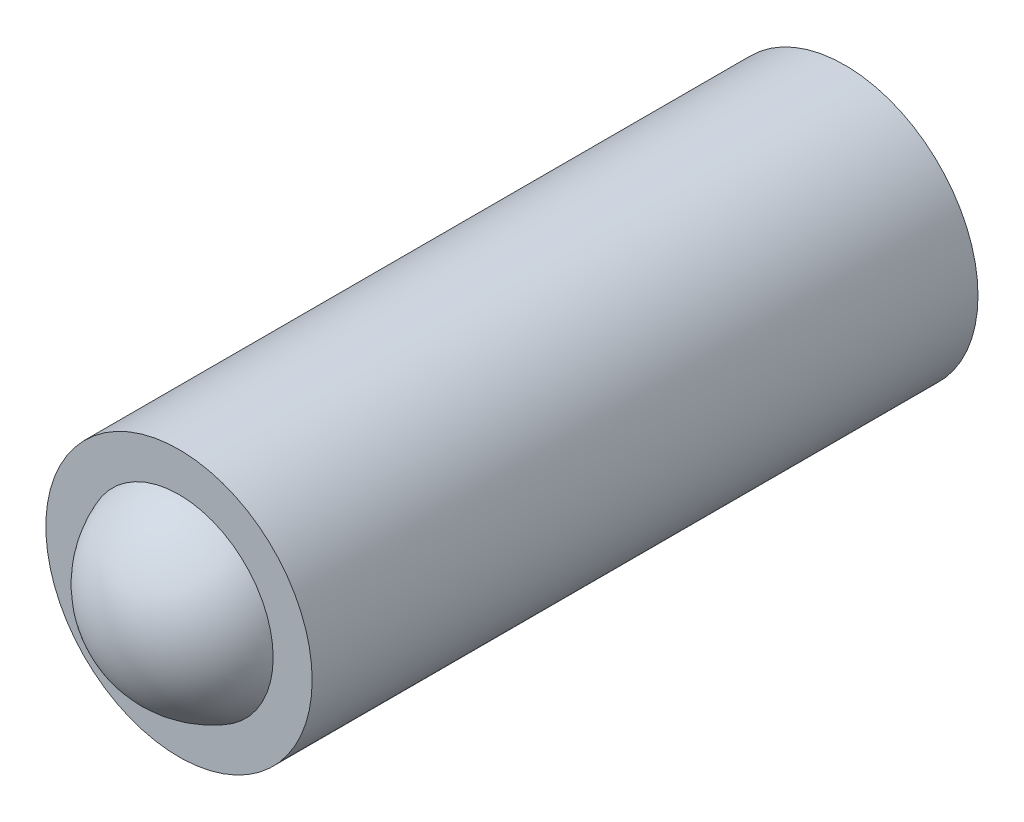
ISO-10303-21;
HEADER;
FILE_DESCRIPTION(('STEP AP214'),'2;1');
FILE_NAME('part.step','',(''),(''),'','','');
FILE_SCHEMA(('AUTOMOTIVE_DESIGN { 1 0 10303 214 1 1 1 1 }'));
ENDSEC;
DATA;
#1=APPLICATION_CONTEXT('core data for automotive mechanical design processes');
#2=APPLICATION_PROTOCOL_DEFINITION('international standard','automotive_design',2000,#1);
#3=PRODUCT_CONTEXT('',#1,'mechanical');
#4=PRODUCT('Part','Part','',(#3));
#5=PRODUCT_RELATED_PRODUCT_CATEGORY('part','',(#4));
#6=PRODUCT_DEFINITION_FORMATION('','',#4);
#7=PRODUCT_DEFINITION_CONTEXT('part definition',#1,'design');
#8=PRODUCT_DEFINITION('design','',#6,#7);
#9=PRODUCT_DEFINITION_SHAPE('','',#8);
#10=(LENGTH_UNIT() NAMED_UNIT(*) SI_UNIT(.MILLI.,.METRE.));
#11=(NAMED_UNIT(*) PLANE_ANGLE_UNIT() SI_UNIT($,.RADIAN.));
#12=(NAMED_UNIT(*) SI_UNIT($,.STERADIAN.) SOLID_ANGLE_UNIT());
#13=UNCERTAINTY_MEASURE_WITH_UNIT(LENGTH_MEASURE(1.E-05),#10,'distance_accuracy_value','');
#14=(GEOMETRIC_REPRESENTATION_CONTEXT(3) GLOBAL_UNCERTAINTY_ASSIGNED_CONTEXT((#13)) GLOBAL_UNIT_ASSIGNED_CONTEXT((#10,
#11,#12)) REPRESENTATION_CONTEXT('',''));
#15=CARTESIAN_POINT('',(0.,0.,0.));
#16=DIRECTION('',(0.,0.,1.));
#17=DIRECTION('',(1.,0.,0.));
#18=AXIS2_PLACEMENT_3D('',#15,#16,#17);
#19=CARTESIAN_POINT('',(0.,0.,-9.));
#20=DIRECTION('',(0.,0.,1.));
#21=DIRECTION('',(0.,-1.,0.));
#22=AXIS2_PLACEMENT_3D('',#19,#20,#21);
#23=SPHERICAL_SURFACE('',#22,3.);
#24=CARTESIAN_POINT('',(0.,0.,-10.));
#25=DIRECTION('',(0.,0.,1.));
#26=DIRECTION('',(1.,0.,0.));
#27=AXIS2_PLACEMENT_3D('',#24,#25,#26);
#28=CIRCLE('',#27,2.82842712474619);
#29=CARTESIAN_POINT('',(2.82842712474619,0.,-10.));
#30=VERTEX_POINT('',#29);
#31=EDGE_CURVE('E26',#30,#30,#28,.T.);
#32=ORIENTED_EDGE('',*,*,#31,.F.);
#33=EDGE_LOOP('',(#32));
#34=FACE_BOUND('',#33,.T.);
#35=ADVANCED_FACE('F12',(#34),#23,.T.);
#36=CARTESIAN_POINT('',(0.,0.,9.));
#37=DIRECTION('',(0.,0.,1.));
#38=DIRECTION('',(0.,1.,0.));
#39=AXIS2_PLACEMENT_3D('',#36,#37,#38);
#40=SPHERICAL_SURFACE('',#39,3.);
#41=CARTESIAN_POINT('',(0.,0.,10.));
#42=DIRECTION('',(0.,0.,1.));
#43=DIRECTION('',(1.,0.,0.));
#44=AXIS2_PLACEMENT_3D('',#41,#42,#43);
#45=CIRCLE('',#44,2.8284271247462);
#46=CARTESIAN_POINT('',(2.8284271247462,0.,10.));
#47=VERTEX_POINT('',#46);
#48=EDGE_CURVE('E8',#47,#47,#45,.T.);
#49=ORIENTED_EDGE('',*,*,#48,.T.);
#50=EDGE_LOOP('',(#49));
#51=FACE_BOUND('',#50,.T.);
#52=ADVANCED_FACE('F36',(#51),#40,.T.);
#53=CARTESIAN_POINT('',(0.,-2.8284271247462,10.));
#54=DIRECTION('',(0.,0.,1.));
#55=DIRECTION('',(1.,0.,0.));
#56=AXIS2_PLACEMENT_3D('',#53,#54,#55);
#57=PLANE('',#56);
#58=CARTESIAN_POINT('',(0.,0.,10.));
#59=DIRECTION('',(0.,0.,1.));
#60=DIRECTION('',(1.,0.,0.));
#61=AXIS2_PLACEMENT_3D('',#58,#59,#60);
#62=CIRCLE('',#61,4.);
#63=CARTESIAN_POINT('',(4.,0.,10.));
#64=VERTEX_POINT('',#63);
#65=EDGE_CURVE('E18',#64,#64,#62,.T.);
#66=ORIENTED_EDGE('',*,*,#65,.T.);
#67=EDGE_LOOP('',(#66));
#68=FACE_BOUND('',#67,.T.);
#69=ORIENTED_EDGE('',*,*,#48,.F.);
#70=EDGE_LOOP('',(#69));
#71=FACE_BOUND('',#70,.T.);
#72=ADVANCED_FACE('F42',(#68,#71),#57,.T.);
#73=CARTESIAN_POINT('',(0.,0.,7.56311397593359));
#74=DIRECTION('',(0.,0.,1.));
#75=DIRECTION('',(1.,0.,0.));
#76=AXIS2_PLACEMENT_3D('',#73,#74,#75);
#77=CYLINDRICAL_SURFACE('',#76,4.);
#78=CARTESIAN_POINT('',(0.,0.,-10.));
#79=DIRECTION('',(0.,0.,1.));
#80=DIRECTION('',(1.,0.,0.));
#81=AXIS2_PLACEMENT_3D('',#78,#79,#80);
#82=CIRCLE('',#81,4.);
#83=CARTESIAN_POINT('',(4.,0.,-10.));
#84=VERTEX_POINT('',#83);
#85=EDGE_CURVE('E22',#84,#84,#82,.T.);
#86=ORIENTED_EDGE('',*,*,#85,.T.);
#87=EDGE_LOOP('',(#86));
#88=FACE_BOUND('',#87,.T.);
#89=ORIENTED_EDGE('',*,*,#65,.F.);
#90=EDGE_LOOP('',(#89));
#91=FACE_BOUND('',#90,.T.);
#92=ADVANCED_FACE('F47',(#88,#91),#77,.T.);
#93=CARTESIAN_POINT('',(0.,-2.82842712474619,-10.));
#94=DIRECTION('',(0.,0.,-1.));
#95=DIRECTION('',(-1.,0.,0.));
#96=AXIS2_PLACEMENT_3D('',#93,#94,#95);
#97=PLANE('',#96);
#98=ORIENTED_EDGE('',*,*,#31,.T.);
#99=EDGE_LOOP('',(#98));
#100=FACE_BOUND('',#99,.T.);
#101=ORIENTED_EDGE('',*,*,#85,.F.);
#102=EDGE_LOOP('',(#101));
#103=FACE_BOUND('',#102,.T.);
#104=ADVANCED_FACE('F32',(#100,#103),#97,.T.);
#105=CLOSED_SHELL('',(#35,#52,#72,#92,#104));
#106=MANIFOLD_SOLID_BREP('B1',#105);
#107=ADVANCED_BREP_SHAPE_REPRESENTATION('',(#18,#106),#14);
#108=SHAPE_DEFINITION_REPRESENTATION(#9,#107);
ENDSEC;
END-ISO-10303-21;
